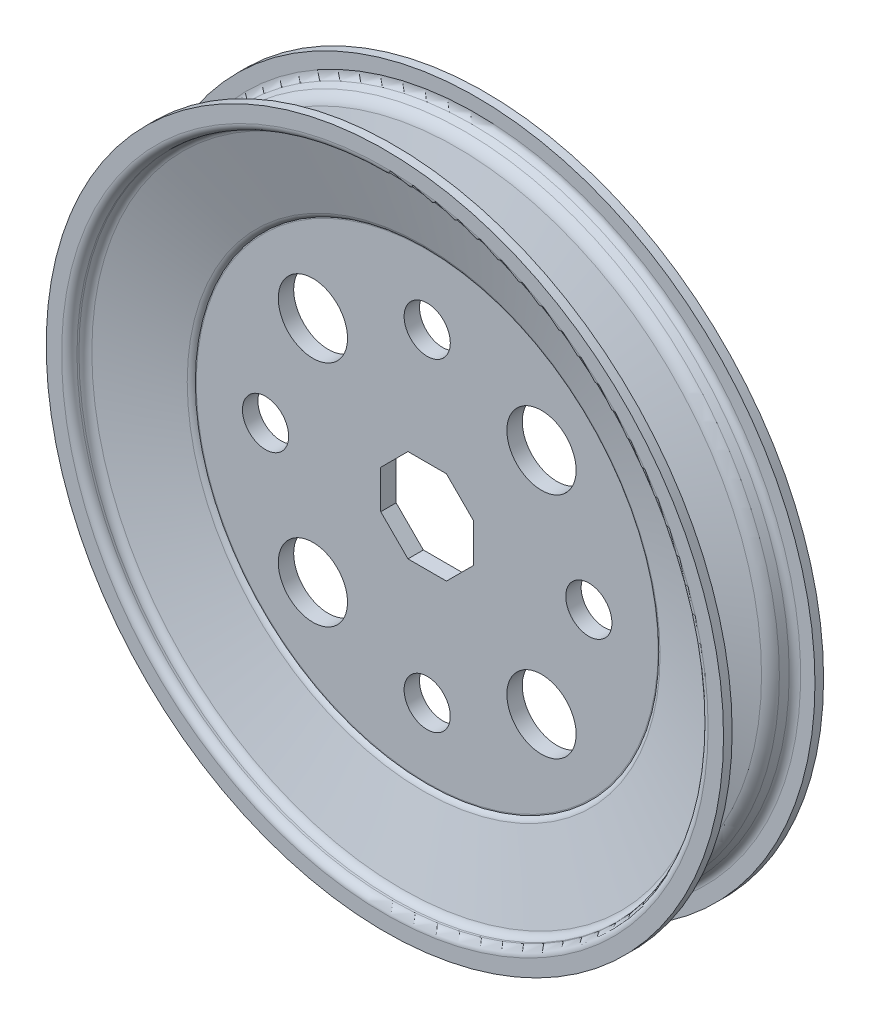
ISO-10303-21;
HEADER;
FILE_DESCRIPTION(('STEP AP214'),'2;1');
FILE_NAME('part.step','',(''),(''),'','','');
FILE_SCHEMA(('AUTOMOTIVE_DESIGN { 1 0 10303 214 1 1 1 1 }'));
ENDSEC;
DATA;
#1=APPLICATION_CONTEXT('core data for automotive mechanical design processes');
#2=APPLICATION_PROTOCOL_DEFINITION('international standard','automotive_design',2000,#1);
#3=PRODUCT_CONTEXT('',#1,'mechanical');
#4=PRODUCT('Part','Part','',(#3));
#5=PRODUCT_RELATED_PRODUCT_CATEGORY('part','',(#4));
#6=PRODUCT_DEFINITION_FORMATION('','',#4);
#7=PRODUCT_DEFINITION_CONTEXT('part definition',#1,'design');
#8=PRODUCT_DEFINITION('design','',#6,#7);
#9=PRODUCT_DEFINITION_SHAPE('','',#8);
#10=(LENGTH_UNIT() NAMED_UNIT(*) SI_UNIT(.MILLI.,.METRE.));
#11=(NAMED_UNIT(*) PLANE_ANGLE_UNIT() SI_UNIT($,.RADIAN.));
#12=(NAMED_UNIT(*) SI_UNIT($,.STERADIAN.) SOLID_ANGLE_UNIT());
#13=UNCERTAINTY_MEASURE_WITH_UNIT(LENGTH_MEASURE(1.E-05),#10,'distance_accuracy_value','');
#14=(GEOMETRIC_REPRESENTATION_CONTEXT(3) GLOBAL_UNCERTAINTY_ASSIGNED_CONTEXT((#13)) GLOBAL_UNIT_ASSIGNED_CONTEXT((#10,
#11,#12)) REPRESENTATION_CONTEXT('',''));
#15=CARTESIAN_POINT('',(0.,0.,0.));
#16=DIRECTION('',(0.,0.,1.));
#17=DIRECTION('',(1.,0.,0.));
#18=AXIS2_PLACEMENT_3D('',#15,#16,#17);
#19=CARTESIAN_POINT('',(0.,0.,-1.25));
#20=DIRECTION('',(0.,0.,-1.));
#21=DIRECTION('',(-1.,0.,0.));
#22=AXIS2_PLACEMENT_3D('',#19,#20,#21);
#23=CONICAL_SURFACE('',#22,30.,1.28351487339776);
#24=CARTESIAN_POINT('',(0.,0.,-1.46173864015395));
#25=DIRECTION('',(0.,0.,1.));
#26=DIRECTION('',(1.,0.,0.));
#27=AXIS2_PLACEMENT_3D('',#24,#25,#26);
#28=CIRCLE('',#27,30.7166538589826);
#29=CARTESIAN_POINT('',(30.7166538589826,0.,-1.46173864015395));
#30=VERTEX_POINT('',#29);
#31=EDGE_CURVE('E173',#30,#30,#28,.T.);
#32=ORIENTED_EDGE('',*,*,#31,.T.);
#33=EDGE_LOOP('',(#32));
#34=FACE_BOUND('',#33,.T.);
#35=CARTESIAN_POINT('',(0.,0.,-4.28826135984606));
#36=DIRECTION('',(0.,0.,-1.));
#37=DIRECTION('',(-1.,0.,0.));
#38=AXIS2_PLACEMENT_3D('',#35,#36,#37);
#39=CIRCLE('',#38,40.2833461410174);
#40=CARTESIAN_POINT('',(-40.2833461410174,0.,-4.28826135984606));
#41=VERTEX_POINT('',#40);
#42=EDGE_CURVE('E176',#41,#41,#39,.T.);
#43=ORIENTED_EDGE('',*,*,#42,.T.);
#44=EDGE_LOOP('',(#43));
#45=FACE_BOUND('',#44,.T.);
#46=ADVANCED_FACE('F28',(#34,#45),#23,.F.);
#47=CARTESIAN_POINT('',(0.,0.,1.));
#48=DIRECTION('',(0.,0.,1.));
#49=DIRECTION('',(1.,0.,0.));
#50=AXIS2_PLACEMENT_3D('',#47,#48,#49);
#51=CYLINDRICAL_SURFACE('',#50,41.);
#52=CARTESIAN_POINT('',(0.,0.,-5.24727906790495));
#53=DIRECTION('',(0.,0.,1.));
#54=DIRECTION('',(1.,0.,0.));
#55=AXIS2_PLACEMENT_3D('',#52,#53,#54);
#56=CIRCLE('',#55,41.);
#57=CARTESIAN_POINT('',(41.,0.,-5.24727906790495));
#58=VERTEX_POINT('',#57);
#59=EDGE_CURVE('E185',#58,#58,#56,.T.);
#60=ORIENTED_EDGE('',*,*,#59,.T.);
#61=EDGE_LOOP('',(#60));
#62=FACE_BOUND('',#61,.T.);
#63=CARTESIAN_POINT('',(0.,0.,-5.5));
#64=DIRECTION('',(0.,0.,1.));
#65=DIRECTION('',(1.,0.,0.));
#66=AXIS2_PLACEMENT_3D('',#63,#64,#65);
#67=CIRCLE('',#66,41.);
#68=CARTESIAN_POINT('',(41.,0.,-5.5));
#69=VERTEX_POINT('',#68);
#70=EDGE_CURVE('E182',#69,#69,#67,.F.);
#71=ORIENTED_EDGE('',*,*,#70,.T.);
#72=EDGE_LOOP('',(#71));
#73=FACE_BOUND('',#72,.T.);
#74=ADVANCED_FACE('F373',(#62,#73),#51,.F.);
#75=CARTESIAN_POINT('',(-44.,0.,-6.5));
#76=DIRECTION('',(0.,0.,1.));
#77=DIRECTION('',(1.,0.,0.));
#78=AXIS2_PLACEMENT_3D('',#75,#76,#77);
#79=PLANE('',#78);
#80=CARTESIAN_POINT('',(0.,0.,-6.5));
#81=DIRECTION('',(0.,0.,1.));
#82=DIRECTION('',(1.,0.,0.));
#83=AXIS2_PLACEMENT_3D('',#80,#81,#82);
#84=CIRCLE('',#83,42.);
#85=CARTESIAN_POINT('',(42.,0.,-6.5));
#86=VERTEX_POINT('',#85);
#87=EDGE_CURVE('E178',#86,#86,#84,.T.);
#88=ORIENTED_EDGE('',*,*,#87,.T.);
#89=EDGE_LOOP('',(#88));
#90=FACE_BOUND('',#89,.T.);
#91=CARTESIAN_POINT('',(0.,0.,-6.5));
#92=DIRECTION('',(0.,0.,1.));
#93=DIRECTION('',(1.,0.,0.));
#94=AXIS2_PLACEMENT_3D('',#91,#92,#93);
#95=CIRCLE('',#94,44.);
#96=CARTESIAN_POINT('',(44.,0.,-6.5));
#97=VERTEX_POINT('',#96);
#98=EDGE_CURVE('E181',#97,#97,#95,.T.);
#99=ORIENTED_EDGE('',*,*,#98,.F.);
#100=EDGE_LOOP('',(#99));
#101=FACE_BOUND('',#100,.T.);
#102=ADVANCED_FACE('F381',(#90,#101),#79,.F.);
#103=CARTESIAN_POINT('',(0.,0.,1.));
#104=DIRECTION('',(0.,0.,1.));
#105=DIRECTION('',(1.,0.,0.));
#106=AXIS2_PLACEMENT_3D('',#103,#104,#105);
#107=CYLINDRICAL_SURFACE('',#106,44.);
#108=CARTESIAN_POINT('',(0.,0.,-5.38));
#109=DIRECTION('',(0.,0.,1.));
#110=DIRECTION('',(1.,0.,0.));
#111=AXIS2_PLACEMENT_3D('',#108,#109,#110);
#112=CIRCLE('',#111,44.);
#113=CARTESIAN_POINT('',(44.,0.,-5.38));
#114=VERTEX_POINT('',#113);
#115=EDGE_CURVE('E242',#114,#114,#112,.T.);
#116=ORIENTED_EDGE('',*,*,#115,.F.);
#117=EDGE_LOOP('',(#116));
#118=FACE_BOUND('',#117,.T.);
#119=ORIENTED_EDGE('',*,*,#98,.T.);
#120=EDGE_LOOP('',(#119));
#121=FACE_BOUND('',#120,.T.);
#122=ADVANCED_FACE('F30',(#118,#121),#107,.T.);
#123=CARTESIAN_POINT('',(0.,0.,-5.24727906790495));
#124=DIRECTION('',(0.,0.,1.));
#125=DIRECTION('',(1.,0.,0.));
#126=AXIS2_PLACEMENT_3D('',#123,#124,#125);
#127=TOROIDAL_SURFACE('',#126,40.,1.);
#128=ORIENTED_EDGE('',*,*,#42,.F.);
#129=EDGE_LOOP('',(#128));
#130=FACE_BOUND('',#129,.T.);
#131=ORIENTED_EDGE('',*,*,#59,.F.);
#132=EDGE_LOOP('',(#131));
#133=FACE_BOUND('',#132,.T.);
#134=ADVANCED_FACE('F391',(#130,#133),#127,.F.);
#135=CARTESIAN_POINT('',(0.,0.,-5.5));
#136=DIRECTION('',(0.,0.,1.));
#137=DIRECTION('',(1.,0.,0.));
#138=AXIS2_PLACEMENT_3D('',#135,#136,#137);
#139=TOROIDAL_SURFACE('',#138,42.,1.);
#140=ORIENTED_EDGE('',*,*,#70,.F.);
#141=EDGE_LOOP('',(#140));
#142=FACE_BOUND('',#141,.T.);
#143=ORIENTED_EDGE('',*,*,#87,.F.);
#144=EDGE_LOOP('',(#143));
#145=FACE_BOUND('',#144,.T.);
#146=ADVANCED_FACE('F394',(#142,#145),#139,.T.);
#147=CARTESIAN_POINT('',(0.,0.,-0.502720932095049));
#148=DIRECTION('',(0.,0.,-1.));
#149=DIRECTION('',(-1.,0.,0.));
#150=AXIS2_PLACEMENT_3D('',#147,#148,#149);
#151=TOROIDAL_SURFACE('',#150,31.,1.);
#152=CARTESIAN_POINT('',(0.,0.,-0.991804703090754));
#153=DIRECTION('',(0.,0.,-1.));
#154=DIRECTION('',(-1.,0.,0.));
#155=AXIS2_PLACEMENT_3D('',#152,#153,#154);
#156=CIRCLE('',#155,30.1277631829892);
#157=CARTESIAN_POINT('',(-30.1277631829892,0.,-0.991804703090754));
#158=VERTEX_POINT('',#157);
#159=EDGE_CURVE('E11',#158,#158,#156,.T.);
#160=ORIENTED_EDGE('',*,*,#159,.F.);
#161=EDGE_LOOP('',(#160));
#162=FACE_BOUND('',#161,.T.);
#163=ORIENTED_EDGE('',*,*,#31,.F.);
#164=EDGE_LOOP('',(#163));
#165=FACE_BOUND('',#164,.T.);
#166=ADVANCED_FACE('F398',(#162,#165),#151,.T.);
#167=CARTESIAN_POINT('',(0.,0.,-0.699999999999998));
#168=DIRECTION('',(0.,0.,-1.));
#169=DIRECTION('',(-1.,0.,0.));
#170=AXIS2_PLACEMENT_3D('',#167,#168,#169);
#171=CONICAL_SURFACE('',#170,32.4,1.10714871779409);
#172=CARTESIAN_POINT('',(0.,0.,0.));
#173=DIRECTION('',(0.,0.,1.));
#174=DIRECTION('',(1.,0.,0.));
#175=AXIS2_PLACEMENT_3D('',#172,#173,#174);
#176=CIRCLE('',#175,31.);
#177=CARTESIAN_POINT('',(31.,0.,0.));
#178=VERTEX_POINT('',#177);
#179=EDGE_CURVE('E171',#178,#178,#176,.T.);
#180=ORIENTED_EDGE('',*,*,#179,.F.);
#181=EDGE_LOOP('',(#180));
#182=FACE_BOUND('',#181,.T.);
#183=CARTESIAN_POINT('',(0.,0.,-0.699999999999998));
#184=DIRECTION('',(0.,0.,1.));
#185=DIRECTION('',(1.,0.,0.));
#186=AXIS2_PLACEMENT_3D('',#183,#184,#185);
#187=CIRCLE('',#186,32.4);
#188=CARTESIAN_POINT('',(32.4,0.,-0.699999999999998));
#189=VERTEX_POINT('',#188);
#190=EDGE_CURVE('E241',#189,#189,#187,.T.);
#191=ORIENTED_EDGE('',*,*,#190,.T.);
#192=EDGE_LOOP('',(#191));
#193=FACE_BOUND('',#192,.T.);
#194=ADVANCED_FACE('F402',(#182,#193),#171,.T.);
#195=CARTESIAN_POINT('',(0.,0.,-3.11));
#196=DIRECTION('',(0.,0.,-1.));
#197=DIRECTION('',(-1.,0.,0.));
#198=AXIS2_PLACEMENT_3D('',#195,#196,#197);
#199=CONICAL_SURFACE('',#198,40.45,1.2799094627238);
#200=CARTESIAN_POINT('',(0.,0.,-2.8515484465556));
#201=DIRECTION('',(0.,0.,1.));
#202=DIRECTION('',(1.,0.,0.));
#203=AXIS2_PLACEMENT_3D('',#200,#201,#202);
#204=CIRCLE('',#203,39.5867074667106);
#205=CARTESIAN_POINT('',(39.5867074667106,0.,-2.8515484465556));
#206=VERTEX_POINT('',#205);
#207=EDGE_CURVE('E252',#206,#206,#204,.T.);
#208=ORIENTED_EDGE('',*,*,#207,.T.);
#209=EDGE_LOOP('',(#208));
#210=FACE_BOUND('',#209,.T.);
#211=ORIENTED_EDGE('',*,*,#190,.F.);
#212=EDGE_LOOP('',(#211));
#213=FACE_BOUND('',#212,.T.);
#214=ADVANCED_FACE('F411',(#210,#213),#199,.T.);
#215=CARTESIAN_POINT('',(0.,0.,-5.38));
#216=DIRECTION('',(0.,0.,-1.));
#217=DIRECTION('',(-1.,0.,0.));
#218=AXIS2_PLACEMENT_3D('',#215,#216,#217);
#219=CONICAL_SURFACE('',#218,41.5,0.433245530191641);
#220=CARTESIAN_POINT('',(0.,0.,-4.79981867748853));
#221=DIRECTION('',(0.,0.,-1.));
#222=DIRECTION('',(-1.,0.,0.));
#223=AXIS2_PLACEMENT_3D('',#220,#221,#222);
#224=CIRCLE('',#223,41.2316341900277);
#225=CARTESIAN_POINT('',(-41.2316341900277,0.,-4.79981867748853));
#226=VERTEX_POINT('',#225);
#227=EDGE_CURVE('E258',#226,#226,#224,.F.);
#228=ORIENTED_EDGE('',*,*,#227,.T.);
#229=EDGE_LOOP('',(#228));
#230=FACE_BOUND('',#229,.T.);
#231=CARTESIAN_POINT('',(0.,0.,-3.92789088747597));
#232=DIRECTION('',(0.,0.,1.));
#233=DIRECTION('',(1.,0.,0.));
#234=AXIS2_PLACEMENT_3D('',#231,#232,#233);
#235=CIRCLE('',#234,40.8283195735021);
#236=CARTESIAN_POINT('',(40.8283195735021,0.,-3.92789088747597));
#237=VERTEX_POINT('',#236);
#238=EDGE_CURVE('E255',#237,#237,#235,.F.);
#239=ORIENTED_EDGE('',*,*,#238,.T.);
#240=EDGE_LOOP('',(#239));
#241=FACE_BOUND('',#240,.T.);
#242=ADVANCED_FACE('F408',(#230,#241),#219,.T.);
#243=CARTESIAN_POINT('',(-44.,0.,-5.38));
#244=DIRECTION('',(0.,0.,-1.));
#245=DIRECTION('',(-1.,0.,0.));
#246=AXIS2_PLACEMENT_3D('',#243,#244,#245);
#247=PLANE('',#246);
#248=CARTESIAN_POINT('',(0.,0.,-5.38));
#249=DIRECTION('',(0.,0.,-1.));
#250=DIRECTION('',(-1.,0.,0.));
#251=AXIS2_PLACEMENT_3D('',#248,#249,#250);
#252=CIRCLE('',#251,42.1392421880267);
#253=CARTESIAN_POINT('',(-42.1392421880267,0.,-5.38));
#254=VERTEX_POINT('',#253);
#255=EDGE_CURVE('E260',#254,#254,#252,.T.);
#256=ORIENTED_EDGE('',*,*,#255,.T.);
#257=EDGE_LOOP('',(#256));
#258=FACE_BOUND('',#257,.T.);
#259=ORIENTED_EDGE('',*,*,#115,.T.);
#260=EDGE_LOOP('',(#259));
#261=FACE_BOUND('',#260,.T.);
#262=ADVANCED_FACE('F404',(#258,#261),#247,.F.);
#263=CARTESIAN_POINT('',(0.,0.,-4.76752824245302));
#264=DIRECTION('',(0.,0.,-1.));
#265=DIRECTION('',(-1.,0.,0.));
#266=AXIS2_PLACEMENT_3D('',#263,#264,#265);
#267=TOROIDAL_SURFACE('',#266,39.0131035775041,2.);
#268=ORIENTED_EDGE('',*,*,#238,.F.);
#269=EDGE_LOOP('',(#268));
#270=FACE_BOUND('',#269,.T.);
#271=ORIENTED_EDGE('',*,*,#207,.F.);
#272=EDGE_LOOP('',(#271));
#273=FACE_BOUND('',#272,.T.);
#274=ADVANCED_FACE('F407',(#270,#273),#267,.T.);
#275=CARTESIAN_POINT('',(0.,0.,-4.38));
#276=DIRECTION('',(0.,0.,-1.));
#277=DIRECTION('',(-1.,0.,0.));
#278=AXIS2_PLACEMENT_3D('',#275,#276,#277);
#279=TOROIDAL_SURFACE('',#278,42.1392421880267,1.);
#280=ORIENTED_EDGE('',*,*,#255,.F.);
#281=EDGE_LOOP('',(#280));
#282=FACE_BOUND('',#281,.T.);
#283=ORIENTED_EDGE('',*,*,#227,.F.);
#284=EDGE_LOOP('',(#283));
#285=FACE_BOUND('',#284,.T.);
#286=ADVANCED_FACE('F457',(#282,#285),#279,.F.);
#287=CARTESIAN_POINT('',(0.,0.,0.));
#288=DIRECTION('',(0.,0.,-1.));
#289=DIRECTION('',(1.,0.,0.));
#290=AXIS2_PLACEMENT_3D('',#287,#288,#289);
#291=TOROIDAL_SURFACE('',#290,30.,1.);
#292=ORIENTED_EDGE('',*,*,#159,.T.);
#293=EDGE_LOOP('',(#292));
#294=FACE_BOUND('',#293,.T.);
#295=CARTESIAN_POINT('',(0.,0.,-1.));
#296=DIRECTION('',(0.,0.,1.));
#297=DIRECTION('',(1.,0.,0.));
#298=AXIS2_PLACEMENT_3D('',#295,#296,#297);
#299=CIRCLE('',#298,30.);
#300=CARTESIAN_POINT('',(30.,0.,-1.));
#301=VERTEX_POINT('',#300);
#302=EDGE_CURVE('E155',#301,#301,#299,.T.);
#303=ORIENTED_EDGE('',*,*,#302,.T.);
#304=EDGE_LOOP('',(#303));
#305=FACE_BOUND('',#304,.T.);
#306=ADVANCED_FACE('F453',(#294,#305),#291,.T.);
#307=CARTESIAN_POINT('',(0.,0.,-1.));
#308=DIRECTION('',(0.,0.,-1.));
#309=DIRECTION('',(1.,0.,0.));
#310=AXIS2_PLACEMENT_3D('',#307,#308,#309);
#311=PLANE('',#310);
#312=ORIENTED_EDGE('',*,*,#302,.F.);
#313=EDGE_LOOP('',(#312));
#314=FACE_BOUND('',#313,.T.);
#315=CARTESIAN_POINT('',(-14.8492424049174,14.8492424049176,-1.));
#316=DIRECTION('',(0.,0.,1.));
#317=DIRECTION('',(0.,1.,0.));
#318=AXIS2_PLACEMENT_3D('',#315,#316,#317);
#319=CIRCLE('',#318,4.5);
#320=CARTESIAN_POINT('',(-14.8492424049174,19.3492424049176,-1.));
#321=VERTEX_POINT('',#320);
#322=EDGE_CURVE('E143',#321,#321,#319,.T.);
#323=ORIENTED_EDGE('',*,*,#322,.T.);
#324=EDGE_LOOP('',(#323));
#325=FACE_BOUND('',#324,.T.);
#326=CARTESIAN_POINT('',(-21.,2.1879734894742E-13,-1.));
#327=DIRECTION('',(0.,0.,1.));
#328=DIRECTION('',(0.,1.,0.));
#329=AXIS2_PLACEMENT_3D('',#326,#327,#328);
#330=CIRCLE('',#329,3.);
#331=CARTESIAN_POINT('',(-21.,3.00000000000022,-1.));
#332=VERTEX_POINT('',#331);
#333=EDGE_CURVE('E140',#332,#332,#330,.T.);
#334=ORIENTED_EDGE('',*,*,#333,.T.);
#335=EDGE_LOOP('',(#334));
#336=FACE_BOUND('',#335,.T.);
#337=CARTESIAN_POINT('',(-14.8492424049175,-14.8492424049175,-1.));
#338=DIRECTION('',(0.,0.,1.));
#339=DIRECTION('',(-1.,0.,0.));
#340=AXIS2_PLACEMENT_3D('',#337,#338,#339);
#341=CIRCLE('',#340,4.5);
#342=CARTESIAN_POINT('',(-19.3492424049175,-14.8492424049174,-1.));
#343=VERTEX_POINT('',#342);
#344=EDGE_CURVE('E137',#343,#343,#341,.T.);
#345=ORIENTED_EDGE('',*,*,#344,.T.);
#346=EDGE_LOOP('',(#345));
#347=FACE_BOUND('',#346,.T.);
#348=CARTESIAN_POINT('',(-1.45476198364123E-13,-21.,-1.));
#349=DIRECTION('',(0.,0.,1.));
#350=DIRECTION('',(-1.,0.,0.));
#351=AXIS2_PLACEMENT_3D('',#348,#349,#350);
#352=CIRCLE('',#351,3.);
#353=CARTESIAN_POINT('',(-3.00000000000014,-21.,-1.));
#354=VERTEX_POINT('',#353);
#355=EDGE_CURVE('E134',#354,#354,#352,.T.);
#356=ORIENTED_EDGE('',*,*,#355,.T.);
#357=EDGE_LOOP('',(#356));
#358=FACE_BOUND('',#357,.T.);
#359=CARTESIAN_POINT('',(14.8492424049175,-14.8492424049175,-1.));
#360=DIRECTION('',(0.,0.,1.));
#361=DIRECTION('',(0.,-1.,0.));
#362=AXIS2_PLACEMENT_3D('',#359,#360,#361);
#363=CIRCLE('',#362,4.5);
#364=CARTESIAN_POINT('',(14.8492424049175,-19.3492424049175,-1.));
#365=VERTEX_POINT('',#364);
#366=EDGE_CURVE('E131',#365,#365,#363,.T.);
#367=ORIENTED_EDGE('',*,*,#366,.T.);
#368=EDGE_LOOP('',(#367));
#369=FACE_BOUND('',#368,.T.);
#370=CARTESIAN_POINT('',(21.,0.,-1.));
#371=DIRECTION('',(0.,0.,1.));
#372=DIRECTION('',(0.,-1.,0.));
#373=AXIS2_PLACEMENT_3D('',#370,#371,#372);
#374=CIRCLE('',#373,3.);
#375=CARTESIAN_POINT('',(21.,-3.00000000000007,-1.));
#376=VERTEX_POINT('',#375);
#377=EDGE_CURVE('E128',#376,#376,#374,.T.);
#378=ORIENTED_EDGE('',*,*,#377,.T.);
#379=EDGE_LOOP('',(#378));
#380=FACE_BOUND('',#379,.T.);
#381=CARTESIAN_POINT('',(14.8492424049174,14.8492424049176,-1.));
#382=DIRECTION('',(0.,0.,1.));
#383=DIRECTION('',(1.,0.,0.));
#384=AXIS2_PLACEMENT_3D('',#381,#382,#383);
#385=CIRCLE('',#384,4.5);
#386=CARTESIAN_POINT('',(19.3492424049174,14.8492424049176,-1.));
#387=VERTEX_POINT('',#386);
#388=EDGE_CURVE('E125',#387,#387,#385,.T.);
#389=ORIENTED_EDGE('',*,*,#388,.T.);
#390=EDGE_LOOP('',(#389));
#391=FACE_BOUND('',#390,.T.);
#392=CARTESIAN_POINT('',(0.,21.,-1.));
#393=DIRECTION('',(0.,0.,1.));
#394=DIRECTION('',(1.,0.,0.));
#395=AXIS2_PLACEMENT_3D('',#392,#393,#394);
#396=CIRCLE('',#395,3.);
#397=CARTESIAN_POINT('',(3.,21.,-1.));
#398=VERTEX_POINT('',#397);
#399=EDGE_CURVE('E122',#398,#398,#396,.T.);
#400=ORIENTED_EDGE('',*,*,#399,.T.);
#401=EDGE_LOOP('',(#400));
#402=FACE_BOUND('',#401,.T.);
#403=DIRECTION('',(0.707106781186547,0.707106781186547,0.));
#404=VECTOR('',#403,1.);
#405=CARTESIAN_POINT('',(2.5,-6.03553390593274,-1.));
#406=LINE('',#405,#404);
#407=CARTESIAN_POINT('',(2.5,-6.03553390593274,-1.));
#408=VERTEX_POINT('',#407);
#409=CARTESIAN_POINT('',(6.03553390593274,-2.5,-1.));
#410=VERTEX_POINT('',#409);
#411=EDGE_CURVE('E109',#408,#410,#406,.T.);
#412=ORIENTED_EDGE('',*,*,#411,.T.);
#413=DIRECTION('',(0.,1.,0.));
#414=VECTOR('',#413,1.);
#415=CARTESIAN_POINT('',(6.03553390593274,-2.5,-1.));
#416=LINE('',#415,#414);
#417=CARTESIAN_POINT('',(6.03553390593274,2.5,-1.));
#418=VERTEX_POINT('',#417);
#419=EDGE_CURVE('E116',#410,#418,#416,.T.);
#420=ORIENTED_EDGE('',*,*,#419,.T.);
#421=DIRECTION('',(-0.707106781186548,0.707106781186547,0.));
#422=VECTOR('',#421,1.);
#423=CARTESIAN_POINT('',(6.03553390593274,2.5,-1.));
#424=LINE('',#423,#422);
#425=CARTESIAN_POINT('',(2.49999999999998,6.03553390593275,-1.));
#426=VERTEX_POINT('',#425);
#427=EDGE_CURVE('E118',#418,#426,#424,.T.);
#428=ORIENTED_EDGE('',*,*,#427,.T.);
#429=DIRECTION('',(-1.,0.,0.));
#430=VECTOR('',#429,1.);
#431=CARTESIAN_POINT('',(2.49999999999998,6.03553390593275,-1.));
#432=LINE('',#431,#430);
#433=CARTESIAN_POINT('',(-2.5,6.03553390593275,-1.));
#434=VERTEX_POINT('',#433);
#435=EDGE_CURVE('E311',#426,#434,#432,.T.);
#436=ORIENTED_EDGE('',*,*,#435,.T.);
#437=DIRECTION('',(-0.707106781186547,-0.707106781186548,0.));
#438=VECTOR('',#437,1.);
#439=CARTESIAN_POINT('',(-2.5,6.03553390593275,-1.));
#440=LINE('',#439,#438);
#441=CARTESIAN_POINT('',(-6.03553390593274,2.5,-1.));
#442=VERTEX_POINT('',#441);
#443=EDGE_CURVE('E312',#434,#442,#440,.T.);
#444=ORIENTED_EDGE('',*,*,#443,.T.);
#445=DIRECTION('',(0.,-1.,0.));
#446=VECTOR('',#445,1.);
#447=CARTESIAN_POINT('',(-6.03553390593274,2.5,-1.));
#448=LINE('',#447,#446);
#449=CARTESIAN_POINT('',(-6.03553390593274,-2.5,-1.));
#450=VERTEX_POINT('',#449);
#451=EDGE_CURVE('E317',#442,#450,#448,.T.);
#452=ORIENTED_EDGE('',*,*,#451,.T.);
#453=DIRECTION('',(0.707106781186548,-0.707106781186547,0.));
#454=VECTOR('',#453,1.);
#455=CARTESIAN_POINT('',(-6.03553390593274,-2.5,-1.));
#456=LINE('',#455,#454);
#457=CARTESIAN_POINT('',(-2.5,-6.03553390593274,-1.));
#458=VERTEX_POINT('',#457);
#459=EDGE_CURVE('E111',#450,#458,#456,.T.);
#460=ORIENTED_EDGE('',*,*,#459,.T.);
#461=DIRECTION('',(1.,0.,0.));
#462=VECTOR('',#461,1.);
#463=CARTESIAN_POINT('',(-2.5,-6.03553390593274,-1.));
#464=LINE('',#463,#462);
#465=EDGE_CURVE('E101',#458,#408,#464,.T.);
#466=ORIENTED_EDGE('',*,*,#465,.T.);
#467=EDGE_LOOP('',(#412,#420,#428,#436,#444,#452,#460,#466));
#468=FACE_BOUND('',#467,.T.);
#469=ADVANCED_FACE('F107',(#314,#325,#336,#347,#358,#369,#380,#391,#402,#468),#311,.T.);
#470=CARTESIAN_POINT('',(-6.03553390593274,-2.5,1.));
#471=DIRECTION('',(0.707106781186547,0.707106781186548,0.));
#472=DIRECTION('',(-0.707106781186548,0.707106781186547,0.));
#473=AXIS2_PLACEMENT_3D('',#470,#471,#472);
#474=PLANE('',#473);
#475=DIRECTION('',(0.,0.,-1.));
#476=VECTOR('',#475,1.);
#477=CARTESIAN_POINT('',(-2.5,-6.03553390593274,1.));
#478=LINE('',#477,#476);
#479=CARTESIAN_POINT('',(-2.5,-6.03553390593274,1.));
#480=VERTEX_POINT('',#479);
#481=EDGE_CURVE('E79',#480,#458,#478,.T.);
#482=ORIENTED_EDGE('',*,*,#481,.T.);
#483=ORIENTED_EDGE('',*,*,#459,.F.);
#484=DIRECTION('',(0.,0.,-1.));
#485=VECTOR('',#484,1.);
#486=CARTESIAN_POINT('',(-6.03553390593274,-2.5,1.));
#487=LINE('',#486,#485);
#488=CARTESIAN_POINT('',(-6.03553390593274,-2.5,1.));
#489=VERTEX_POINT('',#488);
#490=EDGE_CURVE('E204',#489,#450,#487,.T.);
#491=ORIENTED_EDGE('',*,*,#490,.F.);
#492=DIRECTION('',(0.707106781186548,-0.707106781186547,0.));
#493=VECTOR('',#492,1.);
#494=CARTESIAN_POINT('',(-6.03553390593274,-2.5,1.));
#495=LINE('',#494,#493);
#496=EDGE_CURVE('E46',#489,#480,#495,.T.);
#497=ORIENTED_EDGE('',*,*,#496,.T.);
#498=EDGE_LOOP('',(#482,#483,#491,#497));
#499=FACE_BOUND('',#498,.T.);
#500=ADVANCED_FACE('F452',(#499),#474,.T.);
#501=CARTESIAN_POINT('',(-6.03553390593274,2.5,1.));
#502=DIRECTION('',(1.,0.,0.));
#503=DIRECTION('',(0.,0.,-1.));
#504=AXIS2_PLACEMENT_3D('',#501,#502,#503);
#505=PLANE('',#504);
#506=ORIENTED_EDGE('',*,*,#490,.T.);
#507=ORIENTED_EDGE('',*,*,#451,.F.);
#508=DIRECTION('',(0.,0.,-1.));
#509=VECTOR('',#508,1.);
#510=CARTESIAN_POINT('',(-6.03553390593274,2.5,1.));
#511=LINE('',#510,#509);
#512=CARTESIAN_POINT('',(-6.03553390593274,2.5,1.));
#513=VERTEX_POINT('',#512);
#514=EDGE_CURVE('E201',#513,#442,#511,.T.);
#515=ORIENTED_EDGE('',*,*,#514,.F.);
#516=DIRECTION('',(0.,-1.,0.));
#517=VECTOR('',#516,1.);
#518=CARTESIAN_POINT('',(-6.03553390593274,2.5,1.));
#519=LINE('',#518,#517);
#520=EDGE_CURVE('E203',#513,#489,#519,.T.);
#521=ORIENTED_EDGE('',*,*,#520,.T.);
#522=EDGE_LOOP('',(#506,#507,#515,#521));
#523=FACE_BOUND('',#522,.T.);
#524=ADVANCED_FACE('F659',(#523),#505,.T.);
#525=CARTESIAN_POINT('',(-2.5,6.03553390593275,1.));
#526=DIRECTION('',(0.707106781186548,-0.707106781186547,0.));
#527=DIRECTION('',(0.707106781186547,0.707106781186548,0.));
#528=AXIS2_PLACEMENT_3D('',#525,#526,#527);
#529=PLANE('',#528);
#530=ORIENTED_EDGE('',*,*,#514,.T.);
#531=ORIENTED_EDGE('',*,*,#443,.F.);
#532=DIRECTION('',(0.,0.,-1.));
#533=VECTOR('',#532,1.);
#534=CARTESIAN_POINT('',(-2.5,6.03553390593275,1.));
#535=LINE('',#534,#533);
#536=CARTESIAN_POINT('',(-2.5,6.03553390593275,1.));
#537=VERTEX_POINT('',#536);
#538=EDGE_CURVE('E198',#537,#434,#535,.T.);
#539=ORIENTED_EDGE('',*,*,#538,.F.);
#540=DIRECTION('',(-0.707106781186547,-0.707106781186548,0.));
#541=VECTOR('',#540,1.);
#542=CARTESIAN_POINT('',(-2.5,6.03553390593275,1.));
#543=LINE('',#542,#541);
#544=EDGE_CURVE('E200',#537,#513,#543,.T.);
#545=ORIENTED_EDGE('',*,*,#544,.T.);
#546=EDGE_LOOP('',(#530,#531,#539,#545));
#547=FACE_BOUND('',#546,.T.);
#548=ADVANCED_FACE('F648',(#547),#529,.T.);
#549=CARTESIAN_POINT('',(2.49999999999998,6.03553390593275,1.));
#550=DIRECTION('',(0.,-1.,0.));
#551=DIRECTION('',(0.,0.,-1.));
#552=AXIS2_PLACEMENT_3D('',#549,#550,#551);
#553=PLANE('',#552);
#554=ORIENTED_EDGE('',*,*,#538,.T.);
#555=ORIENTED_EDGE('',*,*,#435,.F.);
#556=DIRECTION('',(0.,0.,-1.));
#557=VECTOR('',#556,1.);
#558=CARTESIAN_POINT('',(2.49999999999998,6.03553390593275,1.));
#559=LINE('',#558,#557);
#560=CARTESIAN_POINT('',(2.49999999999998,6.03553390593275,1.));
#561=VERTEX_POINT('',#560);
#562=EDGE_CURVE('E195',#561,#426,#559,.T.);
#563=ORIENTED_EDGE('',*,*,#562,.F.);
#564=DIRECTION('',(-1.,0.,0.));
#565=VECTOR('',#564,1.);
#566=CARTESIAN_POINT('',(2.49999999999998,6.03553390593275,1.));
#567=LINE('',#566,#565);
#568=EDGE_CURVE('E197',#561,#537,#567,.T.);
#569=ORIENTED_EDGE('',*,*,#568,.T.);
#570=EDGE_LOOP('',(#554,#555,#563,#569));
#571=FACE_BOUND('',#570,.T.);
#572=ADVANCED_FACE('F638',(#571),#553,.T.);
#573=CARTESIAN_POINT('',(6.03553390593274,2.5,1.));
#574=DIRECTION('',(-0.707106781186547,-0.707106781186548,0.));
#575=DIRECTION('',(0.707106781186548,-0.707106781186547,0.));
#576=AXIS2_PLACEMENT_3D('',#573,#574,#575);
#577=PLANE('',#576);
#578=ORIENTED_EDGE('',*,*,#562,.T.);
#579=ORIENTED_EDGE('',*,*,#427,.F.);
#580=DIRECTION('',(0.,0.,-1.));
#581=VECTOR('',#580,1.);
#582=CARTESIAN_POINT('',(6.03553390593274,2.5,1.));
#583=LINE('',#582,#581);
#584=CARTESIAN_POINT('',(6.03553390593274,2.5,1.));
#585=VERTEX_POINT('',#584);
#586=EDGE_CURVE('E192',#585,#418,#583,.T.);
#587=ORIENTED_EDGE('',*,*,#586,.F.);
#588=DIRECTION('',(-0.707106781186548,0.707106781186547,0.));
#589=VECTOR('',#588,1.);
#590=CARTESIAN_POINT('',(6.03553390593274,2.5,1.));
#591=LINE('',#590,#589);
#592=EDGE_CURVE('E194',#585,#561,#591,.T.);
#593=ORIENTED_EDGE('',*,*,#592,.T.);
#594=EDGE_LOOP('',(#578,#579,#587,#593));
#595=FACE_BOUND('',#594,.T.);
#596=ADVANCED_FACE('F306',(#595),#577,.T.);
#597=CARTESIAN_POINT('',(6.03553390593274,-2.5,1.));
#598=DIRECTION('',(-1.,0.,0.));
#599=DIRECTION('',(0.,0.,1.));
#600=AXIS2_PLACEMENT_3D('',#597,#598,#599);
#601=PLANE('',#600);
#602=ORIENTED_EDGE('',*,*,#586,.T.);
#603=ORIENTED_EDGE('',*,*,#419,.F.);
#604=DIRECTION('',(0.,0.,-1.));
#605=VECTOR('',#604,1.);
#606=CARTESIAN_POINT('',(6.03553390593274,-2.5,1.));
#607=LINE('',#606,#605);
#608=CARTESIAN_POINT('',(6.03553390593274,-2.5,1.));
#609=VERTEX_POINT('',#608);
#610=EDGE_CURVE('E114',#609,#410,#607,.T.);
#611=ORIENTED_EDGE('',*,*,#610,.F.);
#612=DIRECTION('',(0.,1.,0.));
#613=VECTOR('',#612,1.);
#614=CARTESIAN_POINT('',(6.03553390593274,-2.5,1.));
#615=LINE('',#614,#613);
#616=EDGE_CURVE('E191',#609,#585,#615,.T.);
#617=ORIENTED_EDGE('',*,*,#616,.T.);
#618=EDGE_LOOP('',(#602,#603,#611,#617));
#619=FACE_BOUND('',#618,.T.);
#620=ADVANCED_FACE('F303',(#619),#601,.T.);
#621=CARTESIAN_POINT('',(2.5,-6.03553390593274,1.));
#622=DIRECTION('',(-0.707106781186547,0.707106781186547,0.));
#623=DIRECTION('',(-0.707106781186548,-0.707106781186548,0.));
#624=AXIS2_PLACEMENT_3D('',#621,#622,#623);
#625=PLANE('',#624);
#626=ORIENTED_EDGE('',*,*,#610,.T.);
#627=ORIENTED_EDGE('',*,*,#411,.F.);
#628=DIRECTION('',(0.,0.,-1.));
#629=VECTOR('',#628,1.);
#630=CARTESIAN_POINT('',(2.5,-6.03553390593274,1.));
#631=LINE('',#630,#629);
#632=CARTESIAN_POINT('',(2.5,-6.03553390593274,1.));
#633=VERTEX_POINT('',#632);
#634=EDGE_CURVE('E98',#633,#408,#631,.T.);
#635=ORIENTED_EDGE('',*,*,#634,.F.);
#636=DIRECTION('',(0.707106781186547,0.707106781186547,0.));
#637=VECTOR('',#636,1.);
#638=CARTESIAN_POINT('',(2.5,-6.03553390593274,1.));
#639=LINE('',#638,#637);
#640=EDGE_CURVE('E68',#633,#609,#639,.T.);
#641=ORIENTED_EDGE('',*,*,#640,.T.);
#642=EDGE_LOOP('',(#626,#627,#635,#641));
#643=FACE_BOUND('',#642,.T.);
#644=ADVANCED_FACE('F113',(#643),#625,.T.);
#645=CARTESIAN_POINT('',(-2.5,-6.03553390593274,1.));
#646=DIRECTION('',(0.,1.,0.));
#647=DIRECTION('',(-1.,0.,0.));
#648=AXIS2_PLACEMENT_3D('',#645,#646,#647);
#649=PLANE('',#648);
#650=ORIENTED_EDGE('',*,*,#634,.T.);
#651=ORIENTED_EDGE('',*,*,#465,.F.);
#652=ORIENTED_EDGE('',*,*,#481,.F.);
#653=DIRECTION('',(1.,0.,0.));
#654=VECTOR('',#653,1.);
#655=CARTESIAN_POINT('',(-2.5,-6.03553390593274,1.));
#656=LINE('',#655,#654);
#657=EDGE_CURVE('E75',#480,#633,#656,.T.);
#658=ORIENTED_EDGE('',*,*,#657,.T.);
#659=EDGE_LOOP('',(#650,#651,#652,#658));
#660=FACE_BOUND('',#659,.T.);
#661=ADVANCED_FACE('F100',(#660),#649,.T.);
#662=CARTESIAN_POINT('',(0.,21.,-9.));
#663=DIRECTION('',(0.,0.,1.));
#664=DIRECTION('',(1.,0.,0.));
#665=AXIS2_PLACEMENT_3D('',#662,#663,#664);
#666=CYLINDRICAL_SURFACE('',#665,3.);
#667=CARTESIAN_POINT('',(0.,21.,1.));
#668=DIRECTION('',(0.,0.,1.));
#669=DIRECTION('',(1.,0.,0.));
#670=AXIS2_PLACEMENT_3D('',#667,#668,#669);
#671=CIRCLE('',#670,3.);
#672=CARTESIAN_POINT('',(3.,21.,1.));
#673=VERTEX_POINT('',#672);
#674=EDGE_CURVE('E207',#673,#673,#671,.T.);
#675=ORIENTED_EDGE('',*,*,#674,.T.);
#676=EDGE_LOOP('',(#675));
#677=FACE_BOUND('',#676,.T.);
#678=ORIENTED_EDGE('',*,*,#399,.F.);
#679=EDGE_LOOP('',(#678));
#680=FACE_BOUND('',#679,.T.);
#681=ADVANCED_FACE('F589',(#677,#680),#666,.F.);
#682=CARTESIAN_POINT('',(14.8492424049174,14.8492424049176,-9.));
#683=DIRECTION('',(0.,0.,1.));
#684=DIRECTION('',(1.,0.,0.));
#685=AXIS2_PLACEMENT_3D('',#682,#683,#684);
#686=CYLINDRICAL_SURFACE('',#685,4.5);
#687=CARTESIAN_POINT('',(14.8492424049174,14.8492424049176,1.));
#688=DIRECTION('',(0.,0.,1.));
#689=DIRECTION('',(1.,0.,0.));
#690=AXIS2_PLACEMENT_3D('',#687,#688,#689);
#691=CIRCLE('',#690,4.5);
#692=CARTESIAN_POINT('',(19.3492424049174,14.8492424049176,1.));
#693=VERTEX_POINT('',#692);
#694=EDGE_CURVE('E219',#693,#693,#691,.T.);
#695=ORIENTED_EDGE('',*,*,#694,.T.);
#696=EDGE_LOOP('',(#695));
#697=FACE_BOUND('',#696,.T.);
#698=ORIENTED_EDGE('',*,*,#388,.F.);
#699=EDGE_LOOP('',(#698));
#700=FACE_BOUND('',#699,.T.);
#701=ADVANCED_FACE('F578',(#697,#700),#686,.F.);
#702=CARTESIAN_POINT('',(21.,0.,-9.));
#703=DIRECTION('',(0.,0.,1.));
#704=DIRECTION('',(1.,0.,0.));
#705=AXIS2_PLACEMENT_3D('',#702,#703,#704);
#706=CYLINDRICAL_SURFACE('',#705,3.);
#707=CARTESIAN_POINT('',(21.,0.,1.));
#708=DIRECTION('',(0.,0.,1.));
#709=DIRECTION('',(0.,-1.,0.));
#710=AXIS2_PLACEMENT_3D('',#707,#708,#709);
#711=CIRCLE('',#710,3.);
#712=CARTESIAN_POINT('',(21.,-3.00000000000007,1.));
#713=VERTEX_POINT('',#712);
#714=EDGE_CURVE('E222',#713,#713,#711,.T.);
#715=ORIENTED_EDGE('',*,*,#714,.T.);
#716=EDGE_LOOP('',(#715));
#717=FACE_BOUND('',#716,.T.);
#718=ORIENTED_EDGE('',*,*,#377,.F.);
#719=EDGE_LOOP('',(#718));
#720=FACE_BOUND('',#719,.T.);
#721=ADVANCED_FACE('F567',(#717,#720),#706,.F.);
#722=CARTESIAN_POINT('',(14.8492424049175,-14.8492424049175,-9.));
#723=DIRECTION('',(0.,0.,1.));
#724=DIRECTION('',(1.,0.,0.));
#725=AXIS2_PLACEMENT_3D('',#722,#723,#724);
#726=CYLINDRICAL_SURFACE('',#725,4.5);
#727=CARTESIAN_POINT('',(14.8492424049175,-14.8492424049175,1.));
#728=DIRECTION('',(0.,0.,1.));
#729=DIRECTION('',(0.,-1.,0.));
#730=AXIS2_PLACEMENT_3D('',#727,#728,#729);
#731=CIRCLE('',#730,4.5);
#732=CARTESIAN_POINT('',(14.8492424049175,-19.3492424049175,1.));
#733=VERTEX_POINT('',#732);
#734=EDGE_CURVE('E225',#733,#733,#731,.T.);
#735=ORIENTED_EDGE('',*,*,#734,.T.);
#736=EDGE_LOOP('',(#735));
#737=FACE_BOUND('',#736,.T.);
#738=ORIENTED_EDGE('',*,*,#366,.F.);
#739=EDGE_LOOP('',(#738));
#740=FACE_BOUND('',#739,.T.);
#741=ADVANCED_FACE('F556',(#737,#740),#726,.F.);
#742=CARTESIAN_POINT('',(-1.45476198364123E-13,-21.,-9.));
#743=DIRECTION('',(0.,0.,1.));
#744=DIRECTION('',(1.,0.,0.));
#745=AXIS2_PLACEMENT_3D('',#742,#743,#744);
#746=CYLINDRICAL_SURFACE('',#745,3.);
#747=CARTESIAN_POINT('',(-1.45476198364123E-13,-21.,1.));
#748=DIRECTION('',(0.,0.,1.));
#749=DIRECTION('',(-1.,0.,0.));
#750=AXIS2_PLACEMENT_3D('',#747,#748,#749);
#751=CIRCLE('',#750,3.);
#752=CARTESIAN_POINT('',(-3.00000000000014,-21.,1.));
#753=VERTEX_POINT('',#752);
#754=EDGE_CURVE('E228',#753,#753,#751,.T.);
#755=ORIENTED_EDGE('',*,*,#754,.T.);
#756=EDGE_LOOP('',(#755));
#757=FACE_BOUND('',#756,.T.);
#758=ORIENTED_EDGE('',*,*,#355,.F.);
#759=EDGE_LOOP('',(#758));
#760=FACE_BOUND('',#759,.T.);
#761=ADVANCED_FACE('F545',(#757,#760),#746,.F.);
#762=CARTESIAN_POINT('',(-14.8492424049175,-14.8492424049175,-9.));
#763=DIRECTION('',(0.,0.,1.));
#764=DIRECTION('',(1.,0.,0.));
#765=AXIS2_PLACEMENT_3D('',#762,#763,#764);
#766=CYLINDRICAL_SURFACE('',#765,4.5);
#767=CARTESIAN_POINT('',(-14.8492424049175,-14.8492424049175,1.));
#768=DIRECTION('',(0.,0.,1.));
#769=DIRECTION('',(-1.,0.,0.));
#770=AXIS2_PLACEMENT_3D('',#767,#768,#769);
#771=CIRCLE('',#770,4.5);
#772=CARTESIAN_POINT('',(-19.3492424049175,-14.8492424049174,1.));
#773=VERTEX_POINT('',#772);
#774=EDGE_CURVE('E231',#773,#773,#771,.T.);
#775=ORIENTED_EDGE('',*,*,#774,.T.);
#776=EDGE_LOOP('',(#775));
#777=FACE_BOUND('',#776,.T.);
#778=ORIENTED_EDGE('',*,*,#344,.F.);
#779=EDGE_LOOP('',(#778));
#780=FACE_BOUND('',#779,.T.);
#781=ADVANCED_FACE('F535',(#777,#780),#766,.F.);
#782=CARTESIAN_POINT('',(-21.,2.1879734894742E-13,-9.));
#783=DIRECTION('',(0.,0.,1.));
#784=DIRECTION('',(1.,0.,0.));
#785=AXIS2_PLACEMENT_3D('',#782,#783,#784);
#786=CYLINDRICAL_SURFACE('',#785,3.);
#787=CARTESIAN_POINT('',(-21.,2.1879734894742E-13,1.));
#788=DIRECTION('',(0.,0.,1.));
#789=DIRECTION('',(0.,1.,0.));
#790=AXIS2_PLACEMENT_3D('',#787,#788,#789);
#791=CIRCLE('',#790,3.);
#792=CARTESIAN_POINT('',(-21.,3.00000000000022,1.));
#793=VERTEX_POINT('',#792);
#794=EDGE_CURVE('E234',#793,#793,#791,.T.);
#795=ORIENTED_EDGE('',*,*,#794,.T.);
#796=EDGE_LOOP('',(#795));
#797=FACE_BOUND('',#796,.T.);
#798=ORIENTED_EDGE('',*,*,#333,.F.);
#799=EDGE_LOOP('',(#798));
#800=FACE_BOUND('',#799,.T.);
#801=ADVANCED_FACE('F274',(#797,#800),#786,.F.);
#802=CARTESIAN_POINT('',(0.,0.,0.));
#803=DIRECTION('',(0.,0.,1.));
#804=DIRECTION('',(1.,0.,0.));
#805=AXIS2_PLACEMENT_3D('',#802,#803,#804);
#806=TOROIDAL_SURFACE('',#805,30.,1.);
#807=CARTESIAN_POINT('',(0.,0.,0.991804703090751));
#808=DIRECTION('',(0.,0.,-1.));
#809=DIRECTION('',(-1.,0.,0.));
#810=AXIS2_PLACEMENT_3D('',#807,#808,#809);
#811=CIRCLE('',#810,30.1277631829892);
#812=CARTESIAN_POINT('',(-30.1277631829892,0.,0.991804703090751));
#813=VERTEX_POINT('',#812);
#814=EDGE_CURVE('E32',#813,#813,#811,.T.);
#815=ORIENTED_EDGE('',*,*,#814,.F.);
#816=EDGE_LOOP('',(#815));
#817=FACE_BOUND('',#816,.T.);
#818=CARTESIAN_POINT('',(0.,0.,1.));
#819=DIRECTION('',(0.,0.,1.));
#820=DIRECTION('',(1.,0.,0.));
#821=AXIS2_PLACEMENT_3D('',#818,#819,#820);
#822=CIRCLE('',#821,30.);
#823=CARTESIAN_POINT('',(30.,0.,1.));
#824=VERTEX_POINT('',#823);
#825=EDGE_CURVE('E245',#824,#824,#822,.T.);
#826=ORIENTED_EDGE('',*,*,#825,.F.);
#827=EDGE_LOOP('',(#826));
#828=FACE_BOUND('',#827,.T.);
#829=ADVANCED_FACE('F270',(#817,#828),#806,.T.);
#830=CARTESIAN_POINT('',(0.,0.,1.));
#831=DIRECTION('',(0.,0.,1.));
#832=DIRECTION('',(1.,0.,0.));
#833=AXIS2_PLACEMENT_3D('',#830,#831,#832);
#834=PLANE('',#833);
#835=ORIENTED_EDGE('',*,*,#825,.T.);
#836=EDGE_LOOP('',(#835));
#837=FACE_BOUND('',#836,.T.);
#838=CARTESIAN_POINT('',(-14.8492424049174,14.8492424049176,1.));
#839=DIRECTION('',(0.,0.,1.));
#840=DIRECTION('',(0.,1.,0.));
#841=AXIS2_PLACEMENT_3D('',#838,#839,#840);
#842=CIRCLE('',#841,4.5);
#843=CARTESIAN_POINT('',(-14.8492424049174,19.3492424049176,1.));
#844=VERTEX_POINT('',#843);
#845=EDGE_CURVE('E177',#844,#844,#842,.T.);
#846=ORIENTED_EDGE('',*,*,#845,.F.);
#847=EDGE_LOOP('',(#846));
#848=FACE_BOUND('',#847,.T.);
#849=ORIENTED_EDGE('',*,*,#794,.F.);
#850=EDGE_LOOP('',(#849));
#851=FACE_BOUND('',#850,.T.);
#852=ORIENTED_EDGE('',*,*,#774,.F.);
#853=EDGE_LOOP('',(#852));
#854=FACE_BOUND('',#853,.T.);
#855=ORIENTED_EDGE('',*,*,#754,.F.);
#856=EDGE_LOOP('',(#855));
#857=FACE_BOUND('',#856,.T.);
#858=ORIENTED_EDGE('',*,*,#734,.F.);
#859=EDGE_LOOP('',(#858));
#860=FACE_BOUND('',#859,.T.);
#861=ORIENTED_EDGE('',*,*,#714,.F.);
#862=EDGE_LOOP('',(#861));
#863=FACE_BOUND('',#862,.T.);
#864=ORIENTED_EDGE('',*,*,#694,.F.);
#865=EDGE_LOOP('',(#864));
#866=FACE_BOUND('',#865,.T.);
#867=ORIENTED_EDGE('',*,*,#674,.F.);
#868=EDGE_LOOP('',(#867));
#869=FACE_BOUND('',#868,.T.);
#870=ORIENTED_EDGE('',*,*,#640,.F.);
#871=ORIENTED_EDGE('',*,*,#657,.F.);
#872=ORIENTED_EDGE('',*,*,#496,.F.);
#873=ORIENTED_EDGE('',*,*,#520,.F.);
#874=ORIENTED_EDGE('',*,*,#544,.F.);
#875=ORIENTED_EDGE('',*,*,#568,.F.);
#876=ORIENTED_EDGE('',*,*,#592,.F.);
#877=ORIENTED_EDGE('',*,*,#616,.F.);
#878=EDGE_LOOP('',(#870,#871,#872,#873,#874,#875,#876,#877));
#879=FACE_BOUND('',#878,.T.);
#880=ADVANCED_FACE('F273',(#837,#848,#851,#854,#857,#860,#863,#866,#869,#879),#834,.T.);
#881=CARTESIAN_POINT('',(-14.8492424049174,14.8492424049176,-9.));
#882=DIRECTION('',(0.,0.,1.));
#883=DIRECTION('',(1.,0.,0.));
#884=AXIS2_PLACEMENT_3D('',#881,#882,#883);
#885=CYLINDRICAL_SURFACE('',#884,4.5);
#886=ORIENTED_EDGE('',*,*,#845,.T.);
#887=EDGE_LOOP('',(#886));
#888=FACE_BOUND('',#887,.T.);
#889=ORIENTED_EDGE('',*,*,#322,.F.);
#890=EDGE_LOOP('',(#889));
#891=FACE_BOUND('',#890,.T.);
#892=ADVANCED_FACE('F280',(#888,#891),#885,.F.);
#893=CARTESIAN_POINT('',(0.,0.,1.25));
#894=DIRECTION('',(0.,0.,1.));
#895=DIRECTION('',(-1.,0.,0.));
#896=AXIS2_PLACEMENT_3D('',#893,#894,#895);
#897=CONICAL_SURFACE('',#896,30.,1.28351487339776);
#898=CARTESIAN_POINT('',(0.,0.,1.46173864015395));
#899=DIRECTION('',(0.,0.,1.));
#900=DIRECTION('',(1.,0.,0.));
#901=AXIS2_PLACEMENT_3D('',#898,#899,#900);
#902=CIRCLE('',#901,30.7166538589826);
#903=CARTESIAN_POINT('',(30.7166538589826,0.,1.46173864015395));
#904=VERTEX_POINT('',#903);
#905=EDGE_CURVE('E146',#904,#904,#902,.T.);
#906=ORIENTED_EDGE('',*,*,#905,.F.);
#907=EDGE_LOOP('',(#906));
#908=FACE_BOUND('',#907,.T.);
#909=CARTESIAN_POINT('',(0.,0.,4.28826135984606));
#910=DIRECTION('',(0.,0.,-1.));
#911=DIRECTION('',(-1.,0.,0.));
#912=AXIS2_PLACEMENT_3D('',#909,#910,#911);
#913=CIRCLE('',#912,40.2833461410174);
#914=CARTESIAN_POINT('',(-40.2833461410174,0.,4.28826135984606));
#915=VERTEX_POINT('',#914);
#916=EDGE_CURVE('E326',#915,#915,#913,.T.);
#917=ORIENTED_EDGE('',*,*,#916,.F.);
#918=EDGE_LOOP('',(#917));
#919=FACE_BOUND('',#918,.T.);
#920=ADVANCED_FACE('F334',(#908,#919),#897,.F.);
#921=CARTESIAN_POINT('',(0.,0.,-1.));
#922=DIRECTION('',(0.,0.,-1.));
#923=DIRECTION('',(1.,0.,0.));
#924=AXIS2_PLACEMENT_3D('',#921,#922,#923);
#925=CYLINDRICAL_SURFACE('',#924,41.);
#926=CARTESIAN_POINT('',(0.,0.,5.24727906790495));
#927=DIRECTION('',(0.,0.,1.));
#928=DIRECTION('',(1.,0.,0.));
#929=AXIS2_PLACEMENT_3D('',#926,#927,#928);
#930=CIRCLE('',#929,41.);
#931=CARTESIAN_POINT('',(41.,0.,5.24727906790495));
#932=VERTEX_POINT('',#931);
#933=EDGE_CURVE('E323',#932,#932,#930,.T.);
#934=ORIENTED_EDGE('',*,*,#933,.F.);
#935=EDGE_LOOP('',(#934));
#936=FACE_BOUND('',#935,.T.);
#937=CARTESIAN_POINT('',(0.,0.,5.5));
#938=DIRECTION('',(0.,0.,1.));
#939=DIRECTION('',(1.,0.,0.));
#940=AXIS2_PLACEMENT_3D('',#937,#938,#939);
#941=CIRCLE('',#940,41.);
#942=CARTESIAN_POINT('',(41.,0.,5.5));
#943=VERTEX_POINT('',#942);
#944=EDGE_CURVE('E320',#943,#943,#941,.F.);
#945=ORIENTED_EDGE('',*,*,#944,.F.);
#946=EDGE_LOOP('',(#945));
#947=FACE_BOUND('',#946,.T.);
#948=ADVANCED_FACE('F337',(#936,#947),#925,.F.);
#949=CARTESIAN_POINT('',(-44.,0.,6.5));
#950=DIRECTION('',(0.,0.,-1.));
#951=DIRECTION('',(1.,0.,0.));
#952=AXIS2_PLACEMENT_3D('',#949,#950,#951);
#953=PLANE('',#952);
#954=CARTESIAN_POINT('',(0.,0.,6.5));
#955=DIRECTION('',(0.,0.,1.));
#956=DIRECTION('',(1.,0.,0.));
#957=AXIS2_PLACEMENT_3D('',#954,#955,#956);
#958=CIRCLE('',#957,42.);
#959=CARTESIAN_POINT('',(42.,0.,6.5));
#960=VERTEX_POINT('',#959);
#961=EDGE_CURVE('E151',#960,#960,#958,.T.);
#962=ORIENTED_EDGE('',*,*,#961,.F.);
#963=EDGE_LOOP('',(#962));
#964=FACE_BOUND('',#963,.T.);
#965=CARTESIAN_POINT('',(0.,0.,6.5));
#966=DIRECTION('',(0.,0.,1.));
#967=DIRECTION('',(1.,0.,0.));
#968=AXIS2_PLACEMENT_3D('',#965,#966,#967);
#969=CIRCLE('',#968,44.);
#970=CARTESIAN_POINT('',(44.,0.,6.5));
#971=VERTEX_POINT('',#970);
#972=EDGE_CURVE('E147',#971,#971,#969,.T.);
#973=ORIENTED_EDGE('',*,*,#972,.T.);
#974=EDGE_LOOP('',(#973));
#975=FACE_BOUND('',#974,.T.);
#976=ADVANCED_FACE('F351',(#964,#975),#953,.F.);
#977=CARTESIAN_POINT('',(0.,0.,-1.));
#978=DIRECTION('',(0.,0.,-1.));
#979=DIRECTION('',(1.,0.,0.));
#980=AXIS2_PLACEMENT_3D('',#977,#978,#979);
#981=CYLINDRICAL_SURFACE('',#980,44.);
#982=CARTESIAN_POINT('',(0.,0.,5.38));
#983=DIRECTION('',(0.,0.,1.));
#984=DIRECTION('',(1.,0.,0.));
#985=AXIS2_PLACEMENT_3D('',#982,#983,#984);
#986=CIRCLE('',#985,44.);
#987=CARTESIAN_POINT('',(44.,0.,5.38));
#988=VERTEX_POINT('',#987);
#989=EDGE_CURVE('E152',#988,#988,#986,.T.);
#990=ORIENTED_EDGE('',*,*,#989,.T.);
#991=EDGE_LOOP('',(#990));
#992=FACE_BOUND('',#991,.T.);
#993=ORIENTED_EDGE('',*,*,#972,.F.);
#994=EDGE_LOOP('',(#993));
#995=FACE_BOUND('',#994,.T.);
#996=ADVANCED_FACE('F345',(#992,#995),#981,.T.);
#997=CARTESIAN_POINT('',(0.,0.,5.24727906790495));
#998=DIRECTION('',(0.,0.,-1.));
#999=DIRECTION('',(1.,0.,0.));
#1000=AXIS2_PLACEMENT_3D('',#997,#998,#999);
#1001=TOROIDAL_SURFACE('',#1000,40.,1.);
#1002=ORIENTED_EDGE('',*,*,#916,.T.);
#1003=EDGE_LOOP('',(#1002));
#1004=FACE_BOUND('',#1003,.T.);
#1005=ORIENTED_EDGE('',*,*,#933,.T.);
#1006=EDGE_LOOP('',(#1005));
#1007=FACE_BOUND('',#1006,.T.);
#1008=ADVANCED_FACE('F341',(#1004,#1007),#1001,.F.);
#1009=CARTESIAN_POINT('',(0.,0.,5.5));
#1010=DIRECTION('',(0.,0.,-1.));
#1011=DIRECTION('',(1.,0.,0.));
#1012=AXIS2_PLACEMENT_3D('',#1009,#1010,#1011);
#1013=TOROIDAL_SURFACE('',#1012,42.,1.);
#1014=ORIENTED_EDGE('',*,*,#944,.T.);
#1015=EDGE_LOOP('',(#1014));
#1016=FACE_BOUND('',#1015,.T.);
#1017=ORIENTED_EDGE('',*,*,#961,.T.);
#1018=EDGE_LOOP('',(#1017));
#1019=FACE_BOUND('',#1018,.T.);
#1020=ADVANCED_FACE('F344',(#1016,#1019),#1013,.T.);
#1021=CARTESIAN_POINT('',(0.,0.,0.502720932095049));
#1022=DIRECTION('',(0.,0.,1.));
#1023=DIRECTION('',(-1.,0.,0.));
#1024=AXIS2_PLACEMENT_3D('',#1021,#1022,#1023);
#1025=TOROIDAL_SURFACE('',#1024,31.,1.);
#1026=ORIENTED_EDGE('',*,*,#814,.T.);
#1027=EDGE_LOOP('',(#1026));
#1028=FACE_BOUND('',#1027,.T.);
#1029=ORIENTED_EDGE('',*,*,#905,.T.);
#1030=EDGE_LOOP('',(#1029));
#1031=FACE_BOUND('',#1030,.T.);
#1032=ADVANCED_FACE('F267',(#1028,#1031),#1025,.T.);
#1033=CARTESIAN_POINT('',(0.,0.,0.699999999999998));
#1034=DIRECTION('',(0.,0.,1.));
#1035=DIRECTION('',(-1.,0.,0.));
#1036=AXIS2_PLACEMENT_3D('',#1033,#1034,#1035);
#1037=CONICAL_SURFACE('',#1036,32.4,1.10714871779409);
#1038=ORIENTED_EDGE('',*,*,#179,.T.);
#1039=EDGE_LOOP('',(#1038));
#1040=FACE_BOUND('',#1039,.T.);
#1041=CARTESIAN_POINT('',(0.,0.,0.699999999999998));
#1042=DIRECTION('',(0.,0.,1.));
#1043=DIRECTION('',(1.,0.,0.));
#1044=AXIS2_PLACEMENT_3D('',#1041,#1042,#1043);
#1045=CIRCLE('',#1044,32.4);
#1046=CARTESIAN_POINT('',(32.4,0.,0.699999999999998));
#1047=VERTEX_POINT('',#1046);
#1048=EDGE_CURVE('E150',#1047,#1047,#1045,.T.);
#1049=ORIENTED_EDGE('',*,*,#1048,.F.);
#1050=EDGE_LOOP('',(#1049));
#1051=FACE_BOUND('',#1050,.T.);
#1052=ADVANCED_FACE('F426',(#1040,#1051),#1037,.T.);
#1053=CARTESIAN_POINT('',(0.,0.,3.11));
#1054=DIRECTION('',(0.,0.,1.));
#1055=DIRECTION('',(-1.,0.,0.));
#1056=AXIS2_PLACEMENT_3D('',#1053,#1054,#1055);
#1057=CONICAL_SURFACE('',#1056,40.45,1.2799094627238);
#1058=CARTESIAN_POINT('',(0.,0.,2.8515484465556));
#1059=DIRECTION('',(0.,0.,1.));
#1060=DIRECTION('',(1.,0.,0.));
#1061=AXIS2_PLACEMENT_3D('',#1058,#1059,#1060);
#1062=CIRCLE('',#1061,39.5867074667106);
#1063=CARTESIAN_POINT('',(39.5867074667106,0.,2.8515484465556));
#1064=VERTEX_POINT('',#1063);
#1065=EDGE_CURVE('E160',#1064,#1064,#1062,.T.);
#1066=ORIENTED_EDGE('',*,*,#1065,.F.);
#1067=EDGE_LOOP('',(#1066));
#1068=FACE_BOUND('',#1067,.T.);
#1069=ORIENTED_EDGE('',*,*,#1048,.T.);
#1070=EDGE_LOOP('',(#1069));
#1071=FACE_BOUND('',#1070,.T.);
#1072=ADVANCED_FACE('F429',(#1068,#1071),#1057,.T.);
#1073=CARTESIAN_POINT('',(0.,0.,5.38));
#1074=DIRECTION('',(0.,0.,1.));
#1075=DIRECTION('',(-1.,0.,0.));
#1076=AXIS2_PLACEMENT_3D('',#1073,#1074,#1075);
#1077=CONICAL_SURFACE('',#1076,41.5,0.433245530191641);
#1078=CARTESIAN_POINT('',(0.,0.,4.79981867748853));
#1079=DIRECTION('',(0.,0.,-1.));
#1080=DIRECTION('',(-1.,0.,0.));
#1081=AXIS2_PLACEMENT_3D('',#1078,#1079,#1080);
#1082=CIRCLE('',#1081,41.2316341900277);
#1083=CARTESIAN_POINT('',(-41.2316341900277,0.,4.79981867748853));
#1084=VERTEX_POINT('',#1083);
#1085=EDGE_CURVE('E166',#1084,#1084,#1082,.F.);
#1086=ORIENTED_EDGE('',*,*,#1085,.F.);
#1087=EDGE_LOOP('',(#1086));
#1088=FACE_BOUND('',#1087,.T.);
#1089=CARTESIAN_POINT('',(0.,0.,3.92789088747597));
#1090=DIRECTION('',(0.,0.,1.));
#1091=DIRECTION('',(1.,0.,0.));
#1092=AXIS2_PLACEMENT_3D('',#1089,#1090,#1091);
#1093=CIRCLE('',#1092,40.8283195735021);
#1094=CARTESIAN_POINT('',(40.8283195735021,0.,3.92789088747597));
#1095=VERTEX_POINT('',#1094);
#1096=EDGE_CURVE('E163',#1095,#1095,#1093,.F.);
#1097=ORIENTED_EDGE('',*,*,#1096,.F.);
#1098=EDGE_LOOP('',(#1097));
#1099=FACE_BOUND('',#1098,.T.);
#1100=ADVANCED_FACE('F433',(#1088,#1099),#1077,.T.);
#1101=CARTESIAN_POINT('',(-44.,0.,5.38));
#1102=DIRECTION('',(0.,0.,1.));
#1103=DIRECTION('',(-1.,0.,0.));
#1104=AXIS2_PLACEMENT_3D('',#1101,#1102,#1103);
#1105=PLANE('',#1104);
#1106=CARTESIAN_POINT('',(0.,0.,5.38));
#1107=DIRECTION('',(0.,0.,-1.));
#1108=DIRECTION('',(-1.,0.,0.));
#1109=AXIS2_PLACEMENT_3D('',#1106,#1107,#1108);
#1110=CIRCLE('',#1109,42.1392421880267);
#1111=CARTESIAN_POINT('',(-42.1392421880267,0.,5.38));
#1112=VERTEX_POINT('',#1111);
#1113=EDGE_CURVE('E169',#1112,#1112,#1110,.T.);
#1114=ORIENTED_EDGE('',*,*,#1113,.F.);
#1115=EDGE_LOOP('',(#1114));
#1116=FACE_BOUND('',#1115,.T.);
#1117=ORIENTED_EDGE('',*,*,#989,.F.);
#1118=EDGE_LOOP('',(#1117));
#1119=FACE_BOUND('',#1118,.T.);
#1120=ADVANCED_FACE('F439',(#1116,#1119),#1105,.F.);
#1121=CARTESIAN_POINT('',(0.,0.,4.76752824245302));
#1122=DIRECTION('',(0.,0.,1.));
#1123=DIRECTION('',(-1.,0.,0.));
#1124=AXIS2_PLACEMENT_3D('',#1121,#1122,#1123);
#1125=TOROIDAL_SURFACE('',#1124,39.0131035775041,2.);
#1126=ORIENTED_EDGE('',*,*,#1096,.T.);
#1127=EDGE_LOOP('',(#1126));
#1128=FACE_BOUND('',#1127,.T.);
#1129=ORIENTED_EDGE('',*,*,#1065,.T.);
#1130=EDGE_LOOP('',(#1129));
#1131=FACE_BOUND('',#1130,.T.);
#1132=ADVANCED_FACE('F446',(#1128,#1131),#1125,.T.);
#1133=CARTESIAN_POINT('',(0.,0.,4.38));
#1134=DIRECTION('',(0.,0.,1.));
#1135=DIRECTION('',(-1.,0.,0.));
#1136=AXIS2_PLACEMENT_3D('',#1133,#1134,#1135);
#1137=TOROIDAL_SURFACE('',#1136,42.1392421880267,1.);
#1138=ORIENTED_EDGE('',*,*,#1113,.T.);
#1139=EDGE_LOOP('',(#1138));
#1140=FACE_BOUND('',#1139,.T.);
#1141=ORIENTED_EDGE('',*,*,#1085,.T.);
#1142=EDGE_LOOP('',(#1141));
#1143=FACE_BOUND('',#1142,.T.);
#1144=ADVANCED_FACE('F461',(#1140,#1143),#1137,.F.);
#1145=CLOSED_SHELL('',(#46,#74,#102,#122,#134,#146,#166,#194,#214,#242,#262,#274,#286,#306,#469,
#500,#524,#548,#572,#596,#620,#644,#661,#681,#701,#721,#741,#761,#781,#801,#829,#880,#892,#920,
#948,#976,#996,#1008,#1020,#1032,#1052,#1072,#1100,#1120,#1132,#1144));
#1146=MANIFOLD_SOLID_BREP('B2',#1145);
#1147=ADVANCED_BREP_SHAPE_REPRESENTATION('',(#18,#1146),#14);
#1148=SHAPE_DEFINITION_REPRESENTATION(#9,#1147);
ENDSEC;
END-ISO-10303-21;
